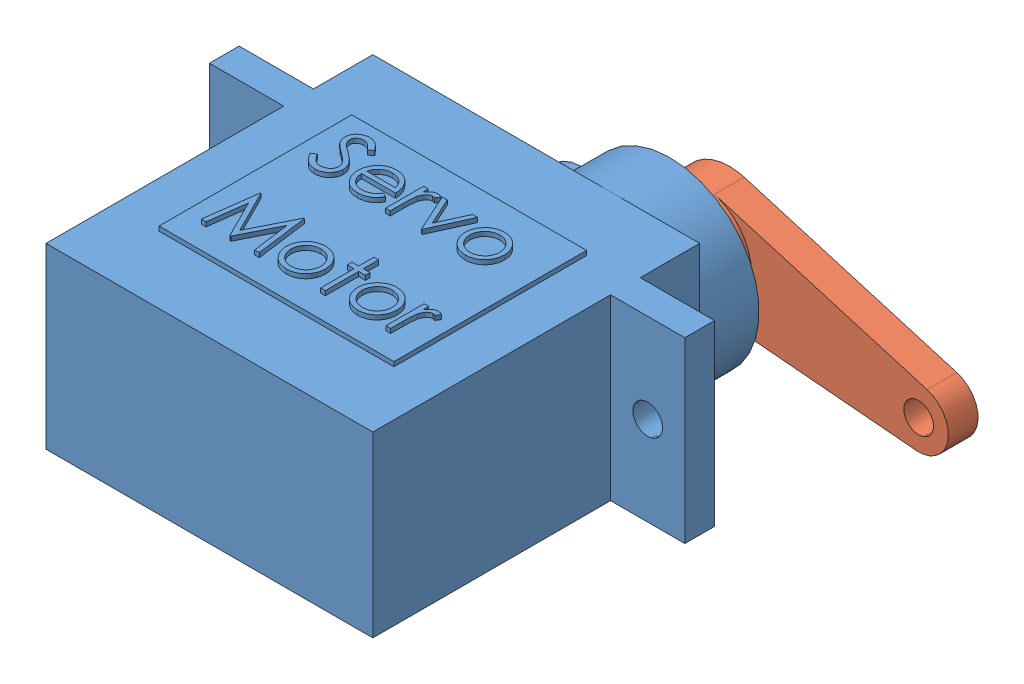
SolidWorks assembly Servo Motor Assembly.SLDASM, configuration Default (file format 8000). Lengths in mm.
Overall size (38.35 13.2 30).
2 component instances, 2 part files, 2 mates.
Components (placement in the parent):
- Servo Motor-1: Servo Motor.SLDPRT [Default] at (17.3719 14.5983 30.233) size (32 12.6 28)
- Servo Motor Link-1: Servo Motor Link.SLDPRT [Default] at (22.3719 20.5983 13.233) x (0.982537 -0.18607 0) z (0.18607 0.982537 0) size (20.5 3 7)
Mates (geometry in assembly coordinates):
- Concentric1: concentric aligned: cylinder of Servo Motor-1 through (22.3719 20.5983 13.233) axis (0 0 1) radius 2.5; cylinder of Servo Motor Link-1 through (22.3719 20.5983 11.233) axis (0 0 1) radius 3.5
- Coincident1: coincident anti-aligned: plane of Servo Motor-1 through (22.3719 20.5983 13.233) normal (0 0 -1); plane of Servo Motor Link-1 through (22.3719 20.5983 13.233) normal (0 0 1)
